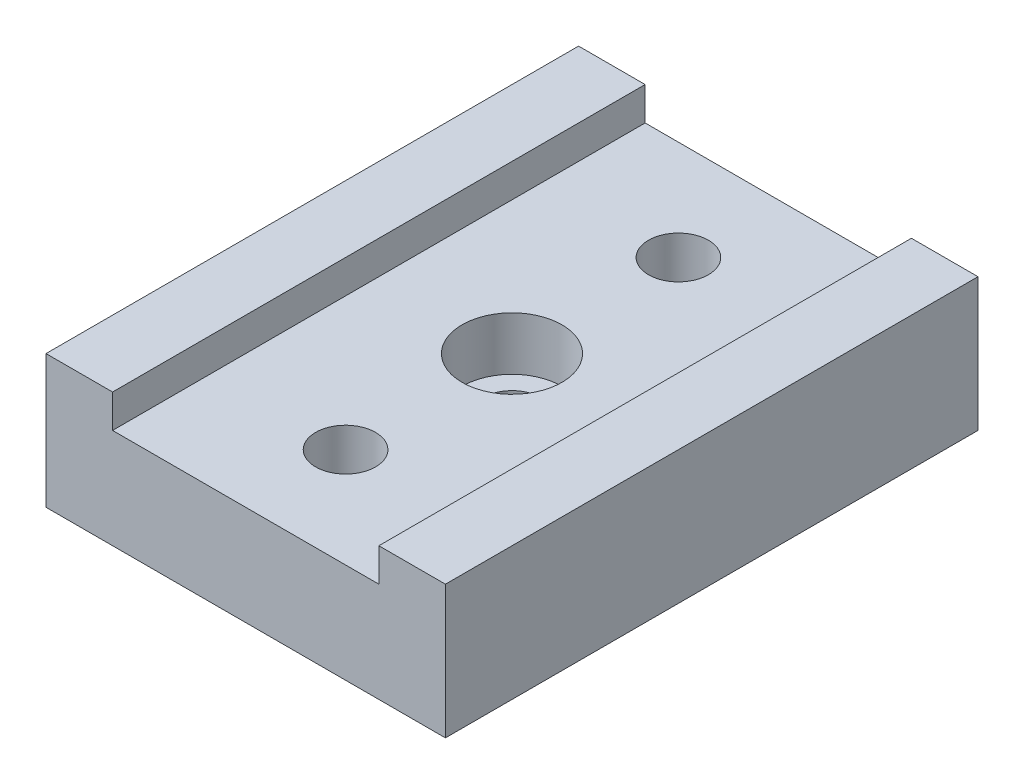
from build123d import *

# Parameters (mm, degrees)
EXTRUDE_1_DEPTH              = 80
HOLE_WIZARD_M8_1_D           = 9
HOLE_WIZARD_M8_1_CBORE_D     = 15
HOLE_WIZARD_M8_1_CBORE_DEPTH = 8
SKETCH_6_R                   = 10
CUT_EXTRUDE_2_DEPTH          = 2
HOLE_WIZARD_M8_2_D           = 9
HOLE_WIZARD_M8_2_CBORE_D     = 15
HOLE_WIZARD_M8_2_CBORE_DEPTH = 8


with BuildPart() as part:
    # Sketch 2 → Extrude 1 (new body)
    with BuildSketch(Plane.XY):
        Polygon((0, 0), (0, 20), (10, 20), (10, 15), (50, 15), (50, 20), (60, 20), (60, 0), align=None)
    extrude(amount=EXTRUDE_1_DEPTH)

    # Hole Wizard M8 _1 (through all)
    with Locations(Plane(origin=(0, 15, 0), x_dir=(-1, 0, 0), z_dir=(0, 1, 0))):
        with Locations((-30, 40)):
            CounterBoreHole(HOLE_WIZARD_M8_1_D / 2, HOLE_WIZARD_M8_1_CBORE_D / 2, HOLE_WIZARD_M8_1_CBORE_DEPTH)

    # Sketch 6 → Cut-Extrude 2 (cut)
    with BuildSketch(Plane.XZ):
        with Locations((30, 40)):
            Circle(SKETCH_6_R)
    extrude(amount=-CUT_EXTRUDE_2_DEPTH, mode=Mode.SUBTRACT)

    # Hole Wizard M8 _2 (through all)
    with Locations(Plane.XZ):
        with Locations((30, 15), (30, 65)):
            CounterBoreHole(HOLE_WIZARD_M8_2_D / 2, HOLE_WIZARD_M8_2_CBORE_D / 2, HOLE_WIZARD_M8_2_CBORE_DEPTH)


solid = part.part
